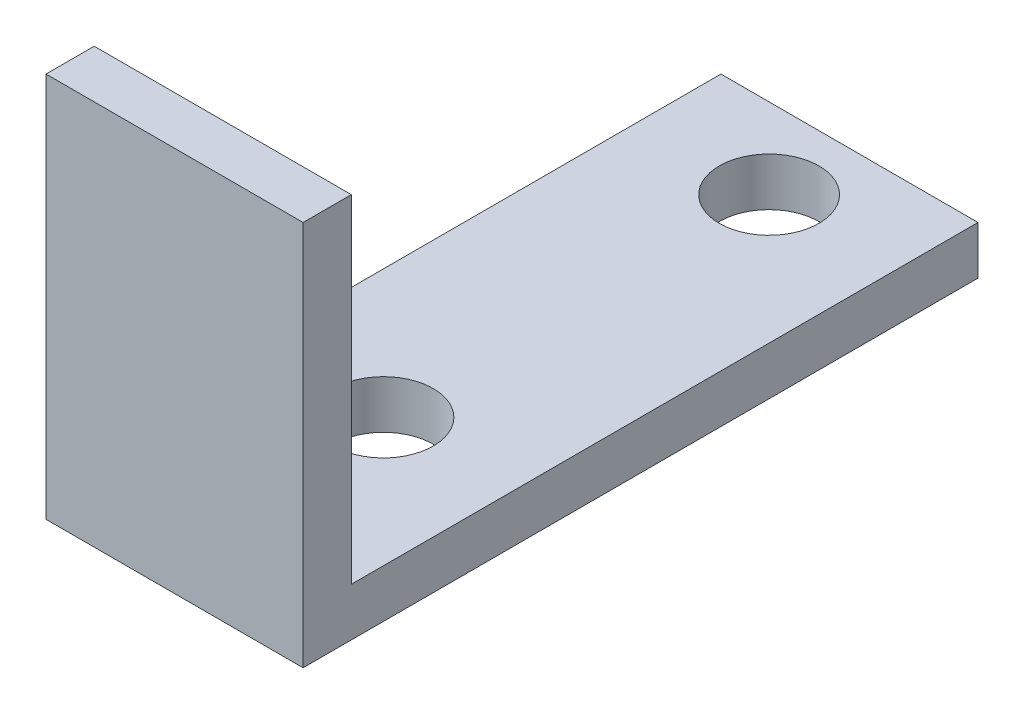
ISO-10303-21;
HEADER;
FILE_DESCRIPTION(('STEP AP214'),'2;1');
FILE_NAME('part.step','',(''),(''),'','','');
FILE_SCHEMA(('AUTOMOTIVE_DESIGN { 1 0 10303 214 1 1 1 1 }'));
ENDSEC;
DATA;
#1=APPLICATION_CONTEXT('core data for automotive mechanical design processes');
#2=APPLICATION_PROTOCOL_DEFINITION('international standard','automotive_design',2000,#1);
#3=PRODUCT_CONTEXT('',#1,'mechanical');
#4=PRODUCT('Part','Part','',(#3));
#5=PRODUCT_RELATED_PRODUCT_CATEGORY('part','',(#4));
#6=PRODUCT_DEFINITION_FORMATION('','',#4);
#7=PRODUCT_DEFINITION_CONTEXT('part definition',#1,'design');
#8=PRODUCT_DEFINITION('design','',#6,#7);
#9=PRODUCT_DEFINITION_SHAPE('','',#8);
#10=(LENGTH_UNIT() NAMED_UNIT(*) SI_UNIT(.MILLI.,.METRE.));
#11=(NAMED_UNIT(*) PLANE_ANGLE_UNIT() SI_UNIT($,.RADIAN.));
#12=(NAMED_UNIT(*) SI_UNIT($,.STERADIAN.) SOLID_ANGLE_UNIT());
#13=UNCERTAINTY_MEASURE_WITH_UNIT(LENGTH_MEASURE(1.E-05),#10,'distance_accuracy_value','');
#14=(GEOMETRIC_REPRESENTATION_CONTEXT(3) GLOBAL_UNCERTAINTY_ASSIGNED_CONTEXT((#13)) GLOBAL_UNIT_ASSIGNED_CONTEXT((#10,
#11,#12)) REPRESENTATION_CONTEXT('',''));
#15=CARTESIAN_POINT('',(0.,0.,0.));
#16=DIRECTION('',(0.,0.,1.));
#17=DIRECTION('',(1.,0.,0.));
#18=AXIS2_PLACEMENT_3D('',#15,#16,#17);
#19=CARTESIAN_POINT('',(8.,0.,-21.));
#20=DIRECTION('',(0.,1.,0.));
#21=DIRECTION('',(0.,0.,1.));
#22=AXIS2_PLACEMENT_3D('',#19,#20,#21);
#23=PLANE('',#22);
#24=CARTESIAN_POINT('',(4.,0.,-18.5));
#25=DIRECTION('',(0.,1.,0.));
#26=DIRECTION('',(0.,0.,1.));
#27=AXIS2_PLACEMENT_3D('',#24,#25,#26);
#28=CIRCLE('',#27,1.55);
#29=CARTESIAN_POINT('',(4.,0.,-16.95));
#30=VERTEX_POINT('',#29);
#31=EDGE_CURVE('E159',#30,#30,#28,.T.);
#32=ORIENTED_EDGE('',*,*,#31,.T.);
#33=EDGE_LOOP('',(#32));
#34=FACE_BOUND('',#33,.T.);
#35=CARTESIAN_POINT('',(4.,0.,-6.5));
#36=DIRECTION('',(0.,1.,0.));
#37=DIRECTION('',(0.,0.,1.));
#38=AXIS2_PLACEMENT_3D('',#35,#36,#37);
#39=CIRCLE('',#38,1.55);
#40=CARTESIAN_POINT('',(4.,0.,-4.95000000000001));
#41=VERTEX_POINT('',#40);
#42=EDGE_CURVE('E120',#41,#41,#39,.T.);
#43=ORIENTED_EDGE('',*,*,#42,.T.);
#44=EDGE_LOOP('',(#43));
#45=FACE_BOUND('',#44,.T.);
#46=DIRECTION('',(0.,0.,-1.));
#47=VECTOR('',#46,1.);
#48=CARTESIAN_POINT('',(0.,0.,-21.));
#49=LINE('',#48,#47);
#50=CARTESIAN_POINT('',(0.,0.,0.));
#51=VERTEX_POINT('',#50);
#52=CARTESIAN_POINT('',(0.,0.,-21.));
#53=VERTEX_POINT('',#52);
#54=EDGE_CURVE('E116',#51,#53,#49,.T.);
#55=ORIENTED_EDGE('',*,*,#54,.T.);
#56=DIRECTION('',(-1.,0.,0.));
#57=VECTOR('',#56,1.);
#58=CARTESIAN_POINT('',(8.,0.,-21.));
#59=LINE('',#58,#57);
#60=CARTESIAN_POINT('',(8.,0.,-21.));
#61=VERTEX_POINT('',#60);
#62=EDGE_CURVE('E11',#61,#53,#59,.T.);
#63=ORIENTED_EDGE('',*,*,#62,.F.);
#64=DIRECTION('',(0.,0.,-1.));
#65=VECTOR('',#64,1.);
#66=CARTESIAN_POINT('',(8.,0.,-21.));
#67=LINE('',#66,#65);
#68=CARTESIAN_POINT('',(8.,0.,0.));
#69=VERTEX_POINT('',#68);
#70=EDGE_CURVE('E127',#69,#61,#67,.T.);
#71=ORIENTED_EDGE('',*,*,#70,.F.);
#72=DIRECTION('',(-1.,0.,0.));
#73=VECTOR('',#72,1.);
#74=CARTESIAN_POINT('',(8.,0.,0.));
#75=LINE('',#74,#73);
#76=EDGE_CURVE('E112',#69,#51,#75,.T.);
#77=ORIENTED_EDGE('',*,*,#76,.T.);
#78=EDGE_LOOP('',(#55,#63,#71,#77));
#79=FACE_BOUND('',#78,.T.);
#80=ADVANCED_FACE('F32',(#34,#45,#79),#23,.F.);
#81=CARTESIAN_POINT('',(8.,1.5,-21.));
#82=DIRECTION('',(0.,0.,1.));
#83=DIRECTION('',(1.,0.,0.));
#84=AXIS2_PLACEMENT_3D('',#81,#82,#83);
#85=PLANE('',#84);
#86=DIRECTION('',(0.,1.,0.));
#87=VECTOR('',#86,1.);
#88=CARTESIAN_POINT('',(0.,1.5,-21.));
#89=LINE('',#88,#87);
#90=CARTESIAN_POINT('',(0.,1.5,-21.));
#91=VERTEX_POINT('',#90);
#92=EDGE_CURVE('E119',#53,#91,#89,.T.);
#93=ORIENTED_EDGE('',*,*,#92,.T.);
#94=DIRECTION('',(-1.,0.,0.));
#95=VECTOR('',#94,1.);
#96=CARTESIAN_POINT('',(8.,1.5,-21.));
#97=LINE('',#96,#95);
#98=CARTESIAN_POINT('',(8.,1.5,-21.));
#99=VERTEX_POINT('',#98);
#100=EDGE_CURVE('E40',#99,#91,#97,.T.);
#101=ORIENTED_EDGE('',*,*,#100,.F.);
#102=DIRECTION('',(0.,1.,0.));
#103=VECTOR('',#102,1.);
#104=CARTESIAN_POINT('',(8.,1.5,-21.));
#105=LINE('',#104,#103);
#106=EDGE_CURVE('E85',#61,#99,#105,.T.);
#107=ORIENTED_EDGE('',*,*,#106,.F.);
#108=ORIENTED_EDGE('',*,*,#62,.T.);
#109=EDGE_LOOP('',(#93,#101,#107,#108));
#110=FACE_BOUND('',#109,.T.);
#111=ADVANCED_FACE('F151',(#110),#85,.F.);
#112=CARTESIAN_POINT('',(8.,1.5,-1.5));
#113=DIRECTION('',(0.,-1.,0.));
#114=DIRECTION('',(0.,0.,-1.));
#115=AXIS2_PLACEMENT_3D('',#112,#113,#114);
#116=PLANE('',#115);
#117=CARTESIAN_POINT('',(4.,1.5,-18.5));
#118=DIRECTION('',(0.,1.,0.));
#119=DIRECTION('',(0.,0.,1.));
#120=AXIS2_PLACEMENT_3D('',#117,#118,#119);
#121=CIRCLE('',#120,1.54999999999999);
#122=CARTESIAN_POINT('',(4.,1.5,-16.95));
#123=VERTEX_POINT('',#122);
#124=EDGE_CURVE('E171',#123,#123,#121,.T.);
#125=ORIENTED_EDGE('',*,*,#124,.F.);
#126=EDGE_LOOP('',(#125));
#127=FACE_BOUND('',#126,.T.);
#128=CARTESIAN_POINT('',(4.,1.5,-6.5));
#129=DIRECTION('',(0.,1.,0.));
#130=DIRECTION('',(0.,0.,1.));
#131=AXIS2_PLACEMENT_3D('',#128,#129,#130);
#132=CIRCLE('',#131,1.54999999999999);
#133=CARTESIAN_POINT('',(4.,1.5,-4.95000000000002));
#134=VERTEX_POINT('',#133);
#135=EDGE_CURVE('E163',#134,#134,#132,.T.);
#136=ORIENTED_EDGE('',*,*,#135,.F.);
#137=EDGE_LOOP('',(#136));
#138=FACE_BOUND('',#137,.T.);
#139=DIRECTION('',(0.,0.,1.));
#140=VECTOR('',#139,1.);
#141=CARTESIAN_POINT('',(0.,1.5,-1.5));
#142=LINE('',#141,#140);
#143=CARTESIAN_POINT('',(0.,1.5,-1.5));
#144=VERTEX_POINT('',#143);
#145=EDGE_CURVE('E122',#91,#144,#142,.T.);
#146=ORIENTED_EDGE('',*,*,#145,.T.);
#147=DIRECTION('',(-1.,0.,0.));
#148=VECTOR('',#147,1.);
#149=CARTESIAN_POINT('',(8.,1.5,-1.5));
#150=LINE('',#149,#148);
#151=CARTESIAN_POINT('',(8.,1.5,-1.5));
#152=VERTEX_POINT('',#151);
#153=EDGE_CURVE('E107',#152,#144,#150,.T.);
#154=ORIENTED_EDGE('',*,*,#153,.F.);
#155=DIRECTION('',(0.,0.,1.));
#156=VECTOR('',#155,1.);
#157=CARTESIAN_POINT('',(8.,1.5,-1.5));
#158=LINE('',#157,#156);
#159=EDGE_CURVE('E98',#99,#152,#158,.T.);
#160=ORIENTED_EDGE('',*,*,#159,.F.);
#161=ORIENTED_EDGE('',*,*,#100,.T.);
#162=EDGE_LOOP('',(#146,#154,#160,#161));
#163=FACE_BOUND('',#162,.T.);
#164=ADVANCED_FACE('F133',(#127,#138,#163),#116,.F.);
#165=CARTESIAN_POINT('',(8.,12.,-1.5));
#166=DIRECTION('',(0.,0.,1.));
#167=DIRECTION('',(0.,-1.,0.));
#168=AXIS2_PLACEMENT_3D('',#165,#166,#167);
#169=PLANE('',#168);
#170=DIRECTION('',(0.,1.,0.));
#171=VECTOR('',#170,1.);
#172=CARTESIAN_POINT('',(0.,12.,-1.5));
#173=LINE('',#172,#171);
#174=CARTESIAN_POINT('',(0.,12.,-1.5));
#175=VERTEX_POINT('',#174);
#176=EDGE_CURVE('E106',#144,#175,#173,.T.);
#177=ORIENTED_EDGE('',*,*,#176,.T.);
#178=DIRECTION('',(-1.,0.,0.));
#179=VECTOR('',#178,1.);
#180=CARTESIAN_POINT('',(8.,12.,-1.5));
#181=LINE('',#180,#179);
#182=CARTESIAN_POINT('',(8.,12.,-1.5));
#183=VERTEX_POINT('',#182);
#184=EDGE_CURVE('E103',#183,#175,#181,.T.);
#185=ORIENTED_EDGE('',*,*,#184,.F.);
#186=DIRECTION('',(0.,1.,0.));
#187=VECTOR('',#186,1.);
#188=CARTESIAN_POINT('',(8.,12.,-1.5));
#189=LINE('',#188,#187);
#190=EDGE_CURVE('E92',#152,#183,#189,.T.);
#191=ORIENTED_EDGE('',*,*,#190,.F.);
#192=ORIENTED_EDGE('',*,*,#153,.T.);
#193=EDGE_LOOP('',(#177,#185,#191,#192));
#194=FACE_BOUND('',#193,.T.);
#195=ADVANCED_FACE('F104',(#194),#169,.F.);
#196=CARTESIAN_POINT('',(8.,12.,0.));
#197=DIRECTION('',(0.,-1.,0.));
#198=DIRECTION('',(0.,0.,-1.));
#199=AXIS2_PLACEMENT_3D('',#196,#197,#198);
#200=PLANE('',#199);
#201=DIRECTION('',(0.,0.,1.));
#202=VECTOR('',#201,1.);
#203=CARTESIAN_POINT('',(0.,12.,0.));
#204=LINE('',#203,#202);
#205=CARTESIAN_POINT('',(0.,12.,0.));
#206=VERTEX_POINT('',#205);
#207=EDGE_CURVE('E71',#175,#206,#204,.T.);
#208=ORIENTED_EDGE('',*,*,#207,.T.);
#209=DIRECTION('',(-1.,0.,0.));
#210=VECTOR('',#209,1.);
#211=CARTESIAN_POINT('',(8.,12.,0.));
#212=LINE('',#211,#210);
#213=CARTESIAN_POINT('',(8.,12.,0.));
#214=VERTEX_POINT('',#213);
#215=EDGE_CURVE('E108',#214,#206,#212,.T.);
#216=ORIENTED_EDGE('',*,*,#215,.F.);
#217=DIRECTION('',(0.,0.,1.));
#218=VECTOR('',#217,1.);
#219=CARTESIAN_POINT('',(8.,12.,0.));
#220=LINE('',#219,#218);
#221=EDGE_CURVE('E96',#183,#214,#220,.T.);
#222=ORIENTED_EDGE('',*,*,#221,.F.);
#223=ORIENTED_EDGE('',*,*,#184,.T.);
#224=EDGE_LOOP('',(#208,#216,#222,#223));
#225=FACE_BOUND('',#224,.T.);
#226=ADVANCED_FACE('F110',(#225),#200,.F.);
#227=CARTESIAN_POINT('',(8.,0.,0.));
#228=DIRECTION('',(0.,0.,-1.));
#229=DIRECTION('',(-1.,0.,0.));
#230=AXIS2_PLACEMENT_3D('',#227,#228,#229);
#231=PLANE('',#230);
#232=DIRECTION('',(0.,-1.,0.));
#233=VECTOR('',#232,1.);
#234=CARTESIAN_POINT('',(0.,0.,0.));
#235=LINE('',#234,#233);
#236=EDGE_CURVE('E77',#206,#51,#235,.T.);
#237=ORIENTED_EDGE('',*,*,#236,.T.);
#238=ORIENTED_EDGE('',*,*,#76,.F.);
#239=DIRECTION('',(0.,-1.,0.));
#240=VECTOR('',#239,1.);
#241=CARTESIAN_POINT('',(8.,0.,0.));
#242=LINE('',#241,#240);
#243=EDGE_CURVE('E48',#214,#69,#242,.T.);
#244=ORIENTED_EDGE('',*,*,#243,.F.);
#245=ORIENTED_EDGE('',*,*,#215,.T.);
#246=EDGE_LOOP('',(#237,#238,#244,#245));
#247=FACE_BOUND('',#246,.T.);
#248=ADVANCED_FACE('F140',(#247),#231,.F.);
#249=CARTESIAN_POINT('',(8.,0.,0.));
#250=DIRECTION('',(-1.,0.,0.));
#251=DIRECTION('',(0.,0.,1.));
#252=AXIS2_PLACEMENT_3D('',#249,#250,#251);
#253=PLANE('',#252);
#254=ORIENTED_EDGE('',*,*,#70,.T.);
#255=ORIENTED_EDGE('',*,*,#106,.T.);
#256=ORIENTED_EDGE('',*,*,#159,.T.);
#257=ORIENTED_EDGE('',*,*,#190,.T.);
#258=ORIENTED_EDGE('',*,*,#221,.T.);
#259=ORIENTED_EDGE('',*,*,#243,.T.);
#260=EDGE_LOOP('',(#254,#255,#256,#257,#258,#259));
#261=FACE_BOUND('',#260,.T.);
#262=ADVANCED_FACE('F94',(#261),#253,.F.);
#263=CARTESIAN_POINT('',(0.,0.,0.));
#264=DIRECTION('',(-1.,0.,0.));
#265=DIRECTION('',(0.,0.,1.));
#266=AXIS2_PLACEMENT_3D('',#263,#264,#265);
#267=PLANE('',#266);
#268=ORIENTED_EDGE('',*,*,#54,.F.);
#269=ORIENTED_EDGE('',*,*,#236,.F.);
#270=ORIENTED_EDGE('',*,*,#207,.F.);
#271=ORIENTED_EDGE('',*,*,#176,.F.);
#272=ORIENTED_EDGE('',*,*,#145,.F.);
#273=ORIENTED_EDGE('',*,*,#92,.F.);
#274=EDGE_LOOP('',(#268,#269,#270,#271,#272,#273));
#275=FACE_BOUND('',#274,.T.);
#276=ADVANCED_FACE('F136',(#275),#267,.T.);
#277=CARTESIAN_POINT('',(4.,1.5,-6.5));
#278=DIRECTION('',(0.,1.,0.));
#279=DIRECTION('',(0.,0.,1.));
#280=AXIS2_PLACEMENT_3D('',#277,#278,#279);
#281=CYLINDRICAL_SURFACE('',#280,1.54999999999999);
#282=ORIENTED_EDGE('',*,*,#42,.F.);
#283=EDGE_LOOP('',(#282));
#284=FACE_BOUND('',#283,.T.);
#285=ORIENTED_EDGE('',*,*,#135,.T.);
#286=EDGE_LOOP('',(#285));
#287=FACE_BOUND('',#286,.T.);
#288=ADVANCED_FACE('F182',(#284,#287),#281,.F.);
#289=CARTESIAN_POINT('',(4.,1.5,-18.5));
#290=DIRECTION('',(0.,1.,0.));
#291=DIRECTION('',(0.,0.,1.));
#292=AXIS2_PLACEMENT_3D('',#289,#290,#291);
#293=CYLINDRICAL_SURFACE('',#292,1.54999999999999);
#294=ORIENTED_EDGE('',*,*,#31,.F.);
#295=EDGE_LOOP('',(#294));
#296=FACE_BOUND('',#295,.T.);
#297=ORIENTED_EDGE('',*,*,#124,.T.);
#298=EDGE_LOOP('',(#297));
#299=FACE_BOUND('',#298,.T.);
#300=ADVANCED_FACE('F175',(#296,#299),#293,.F.);
#301=CLOSED_SHELL('',(#80,#111,#164,#195,#226,#248,#262,#276,#288,#300));
#302=MANIFOLD_SOLID_BREP('B2',#301);
#303=ADVANCED_BREP_SHAPE_REPRESENTATION('',(#18,#302),#14);
#304=SHAPE_DEFINITION_REPRESENTATION(#9,#303);
ENDSEC;
END-ISO-10303-21;
